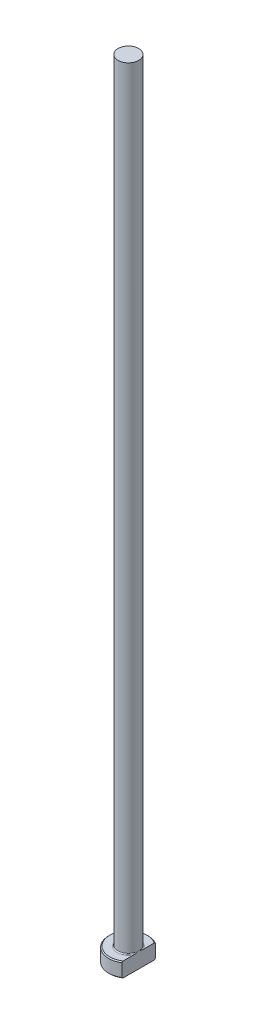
ISO-10303-21;
HEADER;
FILE_DESCRIPTION(('STEP AP214'),'2;1');
FILE_NAME('part.step','',(''),(''),'','','');
FILE_SCHEMA(('AUTOMOTIVE_DESIGN { 1 0 10303 214 1 1 1 1 }'));
ENDSEC;
DATA;
#1=APPLICATION_CONTEXT('core data for automotive mechanical design processes');
#2=APPLICATION_PROTOCOL_DEFINITION('international standard','automotive_design',2000,#1);
#3=PRODUCT_CONTEXT('',#1,'mechanical');
#4=PRODUCT('Part','Part','',(#3));
#5=PRODUCT_RELATED_PRODUCT_CATEGORY('part','',(#4));
#6=PRODUCT_DEFINITION_FORMATION('','',#4);
#7=PRODUCT_DEFINITION_CONTEXT('part definition',#1,'design');
#8=PRODUCT_DEFINITION('design','',#6,#7);
#9=PRODUCT_DEFINITION_SHAPE('','',#8);
#10=(LENGTH_UNIT() NAMED_UNIT(*) SI_UNIT(.MILLI.,.METRE.));
#11=(NAMED_UNIT(*) PLANE_ANGLE_UNIT() SI_UNIT($,.RADIAN.));
#12=(NAMED_UNIT(*) SI_UNIT($,.STERADIAN.) SOLID_ANGLE_UNIT());
#13=UNCERTAINTY_MEASURE_WITH_UNIT(LENGTH_MEASURE(1.E-05),#10,'distance_accuracy_value','');
#14=(GEOMETRIC_REPRESENTATION_CONTEXT(3) GLOBAL_UNCERTAINTY_ASSIGNED_CONTEXT((#13)) GLOBAL_UNIT_ASSIGNED_CONTEXT((#10,
#11,#12)) REPRESENTATION_CONTEXT('',''));
#15=CARTESIAN_POINT('',(0.,0.,0.));
#16=DIRECTION('',(0.,0.,1.));
#17=DIRECTION('',(1.,0.,0.));
#18=AXIS2_PLACEMENT_3D('',#15,#16,#17);
#19=CARTESIAN_POINT('',(0.,0.,0.));
#20=DIRECTION('',(0.,-1.,0.));
#21=DIRECTION('',(0.,0.,-1.));
#22=AXIS2_PLACEMENT_3D('',#19,#20,#21);
#23=PLANE('',#22);
#24=CARTESIAN_POINT('',(0.,0.,0.));
#25=DIRECTION('',(0.,-1.,0.));
#26=DIRECTION('',(0.,0.,-1.));
#27=AXIS2_PLACEMENT_3D('',#24,#25,#26);
#28=CIRCLE('',#27,3.80000000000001);
#29=CARTESIAN_POINT('',(2.09999999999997,0.,3.16701752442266));
#30=VERTEX_POINT('',#29);
#31=CARTESIAN_POINT('',(2.09999999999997,0.,-3.16701752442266));
#32=VERTEX_POINT('',#31);
#33=EDGE_CURVE('E98',#30,#32,#28,.T.);
#34=ORIENTED_EDGE('',*,*,#33,.T.);
#35=DIRECTION('',(0.,0.,1.));
#36=VECTOR('',#35,1.);
#37=CARTESIAN_POINT('',(2.09999999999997,0.,-3.40440890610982));
#38=LINE('',#37,#36);
#39=EDGE_CURVE('E83',#32,#30,#38,.T.);
#40=ORIENTED_EDGE('',*,*,#39,.T.);
#41=EDGE_LOOP('',(#34,#40));
#42=FACE_BOUND('',#41,.T.);
#43=ADVANCED_FACE('F32',(#42),#23,.T.);
#44=CARTESIAN_POINT('',(0.,259.958771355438,0.));
#45=DIRECTION('',(0.,1.,0.));
#46=DIRECTION('',(0.,0.,1.));
#47=AXIS2_PLACEMENT_3D('',#44,#45,#46);
#48=CYLINDRICAL_SURFACE('',#47,3.99999999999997);
#49=CARTESIAN_POINT('',(0.,2.79999999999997,0.));
#50=DIRECTION('',(0.,1.,0.));
#51=DIRECTION('',(0.,0.,1.));
#52=AXIS2_PLACEMENT_3D('',#49,#50,#51);
#53=CIRCLE('',#52,3.99999999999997);
#54=CARTESIAN_POINT('',(2.09999999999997,2.79999999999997,3.40440890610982));
#55=VERTEX_POINT('',#54);
#56=CARTESIAN_POINT('',(2.09999999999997,2.79999999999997,-3.40440890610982));
#57=VERTEX_POINT('',#56);
#58=EDGE_CURVE('E104',#55,#57,#53,.F.);
#59=ORIENTED_EDGE('',*,*,#58,.T.);
#60=DIRECTION('',(0.,-1.,0.));
#61=VECTOR('',#60,1.);
#62=CARTESIAN_POINT('',(2.09999999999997,160.,-3.40440890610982));
#63=LINE('',#62,#61);
#64=CARTESIAN_POINT('',(2.09999999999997,0.199999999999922,-3.40440890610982));
#65=VERTEX_POINT('',#64);
#66=EDGE_CURVE('E183',#57,#65,#63,.T.);
#67=ORIENTED_EDGE('',*,*,#66,.T.);
#68=CARTESIAN_POINT('',(0.,0.199999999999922,0.));
#69=DIRECTION('',(0.,-1.,0.));
#70=DIRECTION('',(0.,0.,-1.));
#71=AXIS2_PLACEMENT_3D('',#68,#69,#70);
#72=CIRCLE('',#71,3.99999999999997);
#73=CARTESIAN_POINT('',(2.09999999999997,0.199999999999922,3.40440890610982));
#74=VERTEX_POINT('',#73);
#75=EDGE_CURVE('E100',#65,#74,#72,.F.);
#76=ORIENTED_EDGE('',*,*,#75,.T.);
#77=DIRECTION('',(0.,-1.,0.));
#78=VECTOR('',#77,1.);
#79=CARTESIAN_POINT('',(2.09999999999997,160.,3.40440890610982));
#80=LINE('',#79,#78);
#81=EDGE_CURVE('E93',#55,#74,#80,.T.);
#82=ORIENTED_EDGE('',*,*,#81,.F.);
#83=EDGE_LOOP('',(#59,#67,#76,#82));
#84=FACE_BOUND('',#83,.T.);
#85=ADVANCED_FACE('F158',(#84),#48,.T.);
#86=CARTESIAN_POINT('',(-3.99999999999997,3.,0.));
#87=DIRECTION('',(0.,1.,0.));
#88=DIRECTION('',(0.,0.,1.));
#89=AXIS2_PLACEMENT_3D('',#86,#87,#88);
#90=PLANE('',#89);
#91=CARTESIAN_POINT('',(0.,3.,0.));
#92=DIRECTION('',(0.,1.,0.));
#93=DIRECTION('',(0.,0.,1.));
#94=AXIS2_PLACEMENT_3D('',#91,#92,#93);
#95=CIRCLE('',#94,3.79999999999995);
#96=CARTESIAN_POINT('',(2.09999999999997,3.,-3.16701752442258));
#97=VERTEX_POINT('',#96);
#98=CARTESIAN_POINT('',(2.09999999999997,3.,3.16701752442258));
#99=VERTEX_POINT('',#98);
#100=EDGE_CURVE('E178',#97,#99,#95,.T.);
#101=ORIENTED_EDGE('',*,*,#100,.T.);
#102=DIRECTION('',(0.,0.,-1.));
#103=VECTOR('',#102,1.);
#104=CARTESIAN_POINT('',(2.09999999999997,3.,0.));
#105=LINE('',#104,#103);
#106=CARTESIAN_POINT('',(2.09999999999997,2.99999999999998,0.938083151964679));
#107=VERTEX_POINT('',#106);
#108=EDGE_CURVE('E57',#99,#107,#105,.T.);
#109=ORIENTED_EDGE('',*,*,#108,.T.);
#110=CARTESIAN_POINT('',(0.,3.,0.));
#111=DIRECTION('',(0.,1.,0.));
#112=DIRECTION('',(0.,0.,1.));
#113=AXIS2_PLACEMENT_3D('',#110,#111,#112);
#114=CIRCLE('',#113,2.29999999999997);
#115=CARTESIAN_POINT('',(2.09999999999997,2.99999999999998,-0.938083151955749));
#116=VERTEX_POINT('',#115);
#117=EDGE_CURVE('E107',#107,#116,#114,.F.);
#118=ORIENTED_EDGE('',*,*,#117,.T.);
#119=EDGE_CURVE('E136',#116,#97,#105,.T.);
#120=ORIENTED_EDGE('',*,*,#119,.T.);
#121=EDGE_LOOP('',(#101,#109,#118,#120));
#122=FACE_BOUND('',#121,.T.);
#123=ADVANCED_FACE('F147',(#122),#90,.T.);
#124=CARTESIAN_POINT('',(0.,3.,0.));
#125=DIRECTION('',(0.,-1.,0.));
#126=DIRECTION('',(0.,0.,-1.));
#127=AXIS2_PLACEMENT_3D('',#124,#125,#126);
#128=CONICAL_SURFACE('',#127,3.79999999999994,0.785398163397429);
#129=ORIENTED_EDGE('',*,*,#58,.F.);
#130=CARTESIAN_POINT('',(2.09999999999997,-0.980423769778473,7.49166163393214));
#131=CARTESIAN_POINT('',(2.09999999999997,-0.831474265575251,7.33696373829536));
#132=CARTESIAN_POINT('',(2.09999999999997,-0.682692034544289,7.1821043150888));
#133=CARTESIAN_POINT('',(2.09999999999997,-0.385548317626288,6.87197961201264));
#134=CARTESIAN_POINT('',(2.09999999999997,-0.237186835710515,6.71671432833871));
#135=CARTESIAN_POINT('',(2.09999999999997,0.0590779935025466,6.40564381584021));
#136=CARTESIAN_POINT('',(2.09999999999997,0.206981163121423,6.24983841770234));
#137=CARTESIAN_POINT('',(2.09999999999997,0.502154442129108,5.9376299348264));
#138=CARTESIAN_POINT('',(2.09999999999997,0.649424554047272,5.78122685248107));
#139=CARTESIAN_POINT('',(2.09999999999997,0.940776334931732,5.47022973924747));
#140=CARTESIAN_POINT('',(2.09999999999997,1.08487085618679,5.31564775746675));
#141=CARTESIAN_POINT('',(2.09999999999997,1.372076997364,5.0055736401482));
#142=CARTESIAN_POINT('',(2.09999999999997,1.51518862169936,4.85008150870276));
#143=CARTESIAN_POINT('',(2.09999999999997,1.80010839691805,4.53794892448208));
#144=CARTESIAN_POINT('',(2.09999999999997,1.94191674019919,4.38130864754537));
#145=CARTESIAN_POINT('',(2.09999999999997,2.22381768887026,4.0664938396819));
#146=CARTESIAN_POINT('',(2.09999999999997,2.36391033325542,3.90831934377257));
#147=CARTESIAN_POINT('',(2.09999999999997,2.60581733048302,3.63104485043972));
#148=CARTESIAN_POINT('',(2.09999999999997,2.70816653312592,3.51241214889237));
#149=CARTESIAN_POINT('',(2.09999999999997,2.91116695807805,3.27367935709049));
#150=CARTESIAN_POINT('',(2.09999999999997,3.01181801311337,3.15357912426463));
#151=CARTESIAN_POINT('',(2.09999999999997,3.21179811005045,2.91033378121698));
#152=CARTESIAN_POINT('',(2.09999999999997,3.3111051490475,2.7871705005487));
#153=CARTESIAN_POINT('',(2.09999999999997,3.50648239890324,2.53834531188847));
#154=CARTESIAN_POINT('',(2.09999999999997,3.60255343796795,2.41268405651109));
#155=CARTESIAN_POINT('',(2.09999999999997,3.79142541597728,2.15619995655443));
#156=CARTESIAN_POINT('',(2.09999999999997,3.88416307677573,2.02532985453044));
#157=CARTESIAN_POINT('',(2.09999999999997,4.01801013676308,1.82534891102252));
#158=CARTESIAN_POINT('',(2.09999999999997,4.06178099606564,1.75802258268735));
#159=CARTESIAN_POINT('',(2.09999999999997,4.14708263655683,1.6219702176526));
#160=CARTESIAN_POINT('',(2.09999999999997,4.18861364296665,1.55324432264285));
#161=CARTESIAN_POINT('',(2.09999999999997,4.2684305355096,1.41491925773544));
#162=CARTESIAN_POINT('',(2.09999999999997,4.30674712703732,1.34533804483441));
#163=CARTESIAN_POINT('',(2.09999999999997,4.37989810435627,1.20437862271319));
#164=CARTESIAN_POINT('',(2.09999999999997,4.41473181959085,1.13300007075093));
#165=CARTESIAN_POINT('',(2.09999999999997,4.51246602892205,0.916193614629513));
#166=CARTESIAN_POINT('',(2.09999999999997,4.56890635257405,0.767589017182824));
#167=CARTESIAN_POINT('',(2.09999999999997,4.63146309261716,0.545044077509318));
#168=CARTESIAN_POINT('',(2.09999999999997,4.6482991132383,0.474096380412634));
#169=CARTESIAN_POINT('',(2.09999999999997,4.67524959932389,0.330910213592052));
#170=CARTESIAN_POINT('',(2.09999999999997,4.68536485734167,0.258671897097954));
#171=CARTESIAN_POINT('',(2.09999999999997,4.69814808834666,0.113837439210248));
#172=CARTESIAN_POINT('',(2.09999999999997,4.70084750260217,0.0412441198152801));
#173=CARTESIAN_POINT('',(2.09999999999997,4.69868618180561,-0.103832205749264));
#174=CARTESIAN_POINT('',(2.09999999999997,4.69382503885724,-0.176315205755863));
#175=CARTESIAN_POINT('',(2.09999999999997,4.67696192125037,-0.319913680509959));
#176=CARTESIAN_POINT('',(2.09999999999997,4.66501009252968,-0.391035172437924));
#177=CARTESIAN_POINT('',(2.09999999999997,4.63477414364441,-0.531925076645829));
#178=CARTESIAN_POINT('',(2.09999999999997,4.61648741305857,-0.601692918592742));
#179=CARTESIAN_POINT('',(2.09999999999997,4.57440952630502,-0.740018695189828));
#180=CARTESIAN_POINT('',(2.09999999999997,4.55058348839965,-0.808565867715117));
#181=CARTESIAN_POINT('',(2.09999999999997,4.49846635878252,-0.943903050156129));
#182=CARTESIAN_POINT('',(2.09999999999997,4.47017609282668,-1.01069338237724));
#183=CARTESIAN_POINT('',(2.09999999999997,4.38350646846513,-1.20069593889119));
#184=CARTESIAN_POINT('',(2.09999999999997,4.32056256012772,-1.3218187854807));
#185=CARTESIAN_POINT('',(2.09999999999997,4.18621189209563,-1.55931752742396));
#186=CARTESIAN_POINT('',(2.09999999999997,4.11479535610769,-1.67568772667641));
#187=CARTESIAN_POINT('',(2.09999999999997,3.96595132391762,-1.90511626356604));
#188=CARTESIAN_POINT('',(2.09999999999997,3.88850194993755,-2.0181602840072));
#189=CARTESIAN_POINT('',(2.09999999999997,3.7296086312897,-2.24129989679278));
#190=CARTESIAN_POINT('',(2.09999999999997,3.64816653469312,-2.3513968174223));
#191=CARTESIAN_POINT('',(2.09999999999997,3.4813341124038,-2.57073305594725));
#192=CARTESIAN_POINT('',(2.09999999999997,3.39590709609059,-2.67994433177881));
#193=CARTESIAN_POINT('',(2.09999999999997,3.22283750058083,-2.89660720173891));
#194=CARTESIAN_POINT('',(2.09999999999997,3.1351947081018,-3.0040586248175));
#195=CARTESIAN_POINT('',(2.09999999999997,2.95843815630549,-3.2173196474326));
#196=CARTESIAN_POINT('',(2.09999999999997,2.86932829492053,-3.32313248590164));
#197=CARTESIAN_POINT('',(2.09999999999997,2.68980874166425,-3.53365081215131));
#198=CARTESIAN_POINT('',(2.09999999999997,2.59939902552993,-3.63835627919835));
#199=CARTESIAN_POINT('',(2.09999999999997,2.36547490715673,-3.90659393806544));
#200=CARTESIAN_POINT('',(2.09999999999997,2.22120602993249,-4.06946765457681));
#201=CARTESIAN_POINT('',(2.09999999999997,1.93085962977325,-4.39359699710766));
#202=CARTESIAN_POINT('',(2.09999999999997,1.78478206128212,-4.55485258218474));
#203=CARTESIAN_POINT('',(2.09999999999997,1.49115582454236,-4.87627982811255));
#204=CARTESIAN_POINT('',(2.09999999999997,1.3436059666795,-5.03645040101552));
#205=CARTESIAN_POINT('',(2.09999999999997,1.04748117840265,-5.3558413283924));
#206=CARTESIAN_POINT('',(2.09999999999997,0.898906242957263,-5.51506167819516));
#207=CARTESIAN_POINT('',(2.09999999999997,0.463656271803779,-5.97917774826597));
#208=CARTESIAN_POINT('',(2.09999999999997,0.175917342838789,-6.28307552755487));
#209=CARTESIAN_POINT('',(2.09999999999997,-0.25695367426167,-6.73740739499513));
#210=CARTESIAN_POINT('',(2.09999999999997,-0.401377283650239,-6.88851889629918));
#211=CARTESIAN_POINT('',(2.09999999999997,-0.690621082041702,-7.1903594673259));
#212=CARTESIAN_POINT('',(2.09999999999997,-0.835441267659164,-7.34108854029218));
#213=CARTESIAN_POINT('',(2.09999999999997,-0.980423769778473,-7.49166163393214));
#214=B_SPLINE_CURVE_WITH_KNOTS('',3,(#130,#131,#132,#133,#134,#135,#136,#137,#138,#139,#140,
#141,#142,#143,#144,#145,#146,#147,#148,#149,#150,#151,#152,#153,#154,#155,#156,#157,#158,#159,
#160,#161,#162,#163,#164,#165,#166,#167,#168,#169,#170,#171,#172,#173,#174,#175,#176,#177,#178,
#179,#180,#181,#182,#183,#184,#185,#186,#187,#188,#189,#190,#191,#192,#193,#194,#195,#196,#197,
#198,#199,#200,#201,#202,#203,#204,#205,#206,#207,#208,#209,#210,#211,#212,#213),.UNSPECIFIED.,
.F.,.F.,(4,2,2,2,2,2,2,2,2,2,2,2,2,2,2,2,2,2,2,2,2,2,2,2,2,2,2,2,2,2,2,2,2,2,2,2,2,2,2,2,2,4),
(0.,0.644249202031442,1.28850446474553,1.93298425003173,2.577461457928,3.21143723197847,
3.84541015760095,4.47928793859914,5.11315128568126,5.58318355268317,6.05326185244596,
6.52785804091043,7.00233182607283,7.48334172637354,7.72421875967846,7.96507152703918,
8.20327136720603,8.441516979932,8.91624038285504,9.13473354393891,9.35320093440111,
9.57074063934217,9.78829208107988,10.0043230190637,10.2204430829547,10.4379628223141,
10.6554423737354,11.0643686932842,11.4737715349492,11.8847351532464,12.2955103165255,
12.7114337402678,13.1273973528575,13.5423929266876,13.9573962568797,14.6101174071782,
15.2628550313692,15.9161714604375,16.5694910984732,17.8249945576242,18.452079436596,
19.0791589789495),.UNSPECIFIED.);
#215=EDGE_CURVE('E135',#55,#99,#214,.T.);
#216=ORIENTED_EDGE('',*,*,#215,.T.);
#217=ORIENTED_EDGE('',*,*,#100,.F.);
#218=EDGE_CURVE('E127',#97,#57,#214,.T.);
#219=ORIENTED_EDGE('',*,*,#218,.T.);
#220=EDGE_LOOP('',(#129,#216,#217,#219));
#221=FACE_BOUND('',#220,.T.);
#222=ADVANCED_FACE('F143',(#221),#128,.T.);
#223=CARTESIAN_POINT('',(0.,0.199999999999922,0.));
#224=DIRECTION('',(0.,1.,0.));
#225=DIRECTION('',(0.,0.,1.));
#226=AXIS2_PLACEMENT_3D('',#223,#224,#225);
#227=CONICAL_SURFACE('',#226,3.99999999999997,0.785398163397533);
#228=ORIENTED_EDGE('',*,*,#75,.F.);
#229=CARTESIAN_POINT('',(2.09999999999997,3.98042376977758,-7.49166163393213));
#230=CARTESIAN_POINT('',(2.09999999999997,3.8314742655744,-7.33696373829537));
#231=CARTESIAN_POINT('',(2.09999999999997,3.68269203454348,-7.18210431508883));
#232=CARTESIAN_POINT('',(2.09999999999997,3.38554831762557,-6.8719796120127));
#233=CARTESIAN_POINT('',(2.09999999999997,3.23718683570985,-6.71671432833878));
#234=CARTESIAN_POINT('',(2.09999999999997,2.94092200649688,-6.40564381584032));
#235=CARTESIAN_POINT('',(2.09999999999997,2.79301883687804,-6.24983841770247));
#236=CARTESIAN_POINT('',(2.09999999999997,2.49784555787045,-5.93762993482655));
#237=CARTESIAN_POINT('',(2.09999999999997,2.35057544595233,-5.78122685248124));
#238=CARTESIAN_POINT('',(2.09999999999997,2.05922366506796,-5.47022973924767));
#239=CARTESIAN_POINT('',(2.09999999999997,1.91512914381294,-5.31564775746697));
#240=CARTESIAN_POINT('',(2.09999999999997,1.62792300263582,-5.00557364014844));
#241=CARTESIAN_POINT('',(2.09999999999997,1.4848113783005,-4.85008150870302));
#242=CARTESIAN_POINT('',(2.09999999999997,1.19989160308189,-4.53794892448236));
#243=CARTESIAN_POINT('',(2.09999999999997,1.0580832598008,-4.38130864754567));
#244=CARTESIAN_POINT('',(2.09999999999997,0.776182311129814,-4.06649383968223));
#245=CARTESIAN_POINT('',(2.09999999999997,0.636089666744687,-3.90831934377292));
#246=CARTESIAN_POINT('',(2.09999999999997,0.394182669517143,-3.63104485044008));
#247=CARTESIAN_POINT('',(2.09999999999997,0.291833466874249,-3.51241214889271));
#248=CARTESIAN_POINT('',(2.09999999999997,0.088833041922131,-3.27367935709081));
#249=CARTESIAN_POINT('',(2.09999999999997,-0.0118180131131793,-3.15357912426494));
#250=CARTESIAN_POINT('',(2.09999999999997,-0.211798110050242,-2.91033378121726));
#251=CARTESIAN_POINT('',(2.09999999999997,-0.31110514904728,-2.78717050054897));
#252=CARTESIAN_POINT('',(2.09999999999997,-0.506482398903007,-2.53834531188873));
#253=CARTESIAN_POINT('',(2.09999999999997,-0.602553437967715,-2.41268405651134));
#254=CARTESIAN_POINT('',(2.09999999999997,-0.791425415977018,-2.15619995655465));
#255=CARTESIAN_POINT('',(2.09999999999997,-0.88416307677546,-2.02532985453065));
#256=CARTESIAN_POINT('',(2.09999999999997,-1.0180101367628,-1.82534891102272));
#257=CARTESIAN_POINT('',(2.09999999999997,-1.06178099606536,-1.75802258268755));
#258=CARTESIAN_POINT('',(2.09999999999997,-1.14708263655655,-1.62197021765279));
#259=CARTESIAN_POINT('',(2.09999999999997,-1.18861364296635,-1.55324432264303));
#260=CARTESIAN_POINT('',(2.09999999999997,-1.2684305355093,-1.41491925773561));
#261=CARTESIAN_POINT('',(2.09999999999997,-1.30674712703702,-1.34533804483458));
#262=CARTESIAN_POINT('',(2.09999999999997,-1.37989810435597,-1.20437862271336));
#263=CARTESIAN_POINT('',(2.09999999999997,-1.41473181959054,-1.1330000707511));
#264=CARTESIAN_POINT('',(2.09999999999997,-1.51246602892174,-0.916193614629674));
#265=CARTESIAN_POINT('',(2.09999999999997,-1.56890635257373,-0.767589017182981));
#266=CARTESIAN_POINT('',(2.09999999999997,-1.63146309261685,-0.545044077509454));
#267=CARTESIAN_POINT('',(2.09999999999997,-1.64829911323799,-0.474096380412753));
#268=CARTESIAN_POINT('',(2.09999999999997,-1.6752495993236,-0.330910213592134));
#269=CARTESIAN_POINT('',(2.09999999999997,-1.68536485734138,-0.258671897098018));
#270=CARTESIAN_POINT('',(2.09999999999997,-1.69814808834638,-0.113837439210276));
#271=CARTESIAN_POINT('',(2.09999999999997,-1.70084750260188,-0.0412441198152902));
#272=CARTESIAN_POINT('',(2.09999999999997,-1.69868618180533,0.10383220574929));
#273=CARTESIAN_POINT('',(2.09999999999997,-1.69382503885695,0.176315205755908));
#274=CARTESIAN_POINT('',(2.09999999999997,-1.67696192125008,0.31991368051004));
#275=CARTESIAN_POINT('',(2.09999999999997,-1.66501009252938,0.391035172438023));
#276=CARTESIAN_POINT('',(2.09999999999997,-1.6347741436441,0.531925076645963));
#277=CARTESIAN_POINT('',(2.09999999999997,-1.61648741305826,0.601692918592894));
#278=CARTESIAN_POINT('',(2.09999999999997,-1.57440952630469,0.740018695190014));
#279=CARTESIAN_POINT('',(2.09999999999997,-1.55058348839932,0.808565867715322));
#280=CARTESIAN_POINT('',(2.09999999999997,-1.49846635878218,0.943903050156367));
#281=CARTESIAN_POINT('',(2.09999999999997,-1.47017609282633,1.01069338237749));
#282=CARTESIAN_POINT('',(2.09999999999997,-1.38350646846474,1.20069593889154));
#283=CARTESIAN_POINT('',(2.09999999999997,-1.32056256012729,1.32181878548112));
#284=CARTESIAN_POINT('',(2.09999999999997,-1.18621189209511,1.55931752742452));
#285=CARTESIAN_POINT('',(2.09999999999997,-1.11479535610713,1.67568772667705));
#286=CARTESIAN_POINT('',(2.09999999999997,-0.965951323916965,1.90511626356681));
#287=CARTESIAN_POINT('',(2.09999999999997,-0.888501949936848,2.01816028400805));
#288=CARTESIAN_POINT('',(2.09999999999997,-0.729608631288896,2.24129989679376));
#289=CARTESIAN_POINT('',(2.09999999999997,-0.648166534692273,2.35139681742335));
#290=CARTESIAN_POINT('',(2.09999999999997,-0.481334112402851,2.57073305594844));
#291=CARTESIAN_POINT('',(2.09999999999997,-0.395907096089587,2.67994433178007));
#292=CARTESIAN_POINT('',(2.09999999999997,-0.222837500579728,2.89660720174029));
#293=CARTESIAN_POINT('',(2.09999999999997,-0.135194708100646,3.00405862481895));
#294=CARTESIAN_POINT('',(2.09999999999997,0.0415618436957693,3.21731964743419));
#295=CARTESIAN_POINT('',(2.09999999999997,0.130671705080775,3.32313248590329));
#296=CARTESIAN_POINT('',(2.09999999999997,0.310191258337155,3.5336508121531));
#297=CARTESIAN_POINT('',(2.09999999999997,0.40060097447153,3.63835627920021));
#298=CARTESIAN_POINT('',(2.09999999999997,0.634525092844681,3.90659393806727));
#299=CARTESIAN_POINT('',(2.09999999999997,0.778793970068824,4.06946765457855));
#300=CARTESIAN_POINT('',(2.09999999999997,1.06914037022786,4.39359699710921));
#301=CARTESIAN_POINT('',(2.09999999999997,1.21521793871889,4.5548525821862));
#302=CARTESIAN_POINT('',(2.09999999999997,1.50884417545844,4.87627982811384));
#303=CARTESIAN_POINT('',(2.09999999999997,1.65639403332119,5.03645040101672));
#304=CARTESIAN_POINT('',(2.09999999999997,1.95251882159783,5.35584132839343));
#305=CARTESIAN_POINT('',(2.09999999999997,2.10109375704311,5.5150616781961));
#306=CARTESIAN_POINT('',(2.09999999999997,2.5363437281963,5.97917774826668));
#307=CARTESIAN_POINT('',(2.09999999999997,2.82408265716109,6.28307552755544));
#308=CARTESIAN_POINT('',(2.09999999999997,3.25695367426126,6.73740739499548));
#309=CARTESIAN_POINT('',(2.09999999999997,3.40137728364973,6.88851889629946));
#310=CARTESIAN_POINT('',(2.09999999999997,3.690621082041,7.19035946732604));
#311=CARTESIAN_POINT('',(2.09999999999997,3.83544126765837,7.34108854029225));
#312=CARTESIAN_POINT('',(2.09999999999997,3.98042376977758,7.49166163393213));
#313=B_SPLINE_CURVE_WITH_KNOTS('',3,(#229,#230,#231,#232,#233,#234,#235,#236,#237,#238,#239,
#240,#241,#242,#243,#244,#245,#246,#247,#248,#249,#250,#251,#252,#253,#254,#255,#256,#257,#258,
#259,#260,#261,#262,#263,#264,#265,#266,#267,#268,#269,#270,#271,#272,#273,#274,#275,#276,#277,
#278,#279,#280,#281,#282,#283,#284,#285,#286,#287,#288,#289,#290,#291,#292,#293,#294,#295,#296,
#297,#298,#299,#300,#301,#302,#303,#304,#305,#306,#307,#308,#309,#310,#311,#312),.UNSPECIFIED.,
.F.,.F.,(4,2,2,2,2,2,2,2,2,2,2,2,2,2,2,2,2,2,2,2,2,2,2,2,2,2,2,2,2,2,2,2,2,2,2,2,2,2,2,2,2,4),
(0.,0.644249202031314,1.28850446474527,1.93298425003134,2.57746145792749,3.21143723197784,
3.84541015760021,4.47928793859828,5.11315128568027,5.5831835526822,6.053261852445,
6.52785804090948,7.00233182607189,7.48334172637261,7.72421875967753,7.96507152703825,
8.20327136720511,8.44151697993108,8.91624038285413,9.13473354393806,9.35320093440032,
9.57074063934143,9.7882920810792,10.0043230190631,10.2204430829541,10.4379628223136,
10.6554423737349,11.064368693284,11.4737715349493,11.8847351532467,12.295510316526,
12.7114337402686,13.1273973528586,13.5423929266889,13.9573962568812,14.6101174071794,
15.2628550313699,15.9161714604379,16.5694910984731,17.8249945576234,18.4520794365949,
19.079158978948),.UNSPECIFIED.);
#314=EDGE_CURVE('E86',#65,#32,#313,.T.);
#315=ORIENTED_EDGE('',*,*,#314,.T.);
#316=ORIENTED_EDGE('',*,*,#33,.F.);
#317=EDGE_CURVE('E89',#30,#74,#313,.T.);
#318=ORIENTED_EDGE('',*,*,#317,.T.);
#319=EDGE_LOOP('',(#228,#315,#316,#318));
#320=FACE_BOUND('',#319,.T.);
#321=ADVANCED_FACE('F97',(#320),#227,.T.);
#322=CARTESIAN_POINT('',(0.,3.19999999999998,0.));
#323=DIRECTION('',(0.,1.,0.));
#324=DIRECTION('',(0.,0.,1.));
#325=AXIS2_PLACEMENT_3D('',#322,#323,#324);
#326=TOROIDAL_SURFACE('',#325,2.29999999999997,0.2);
#327=CARTESIAN_POINT('',(2.09999999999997,3.19999999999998,0.));
#328=CARTESIAN_POINT('',(2.09999999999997,3.20000050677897,1.12871213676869E-10));
#329=CARTESIAN_POINT('',(2.09999999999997,3.20000101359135,-1.5160230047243E-07));
#330=CARTESIAN_POINT('',(2.09999999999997,3.20000197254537,-5.98005719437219E-07));
#331=CARTESIAN_POINT('',(2.09999999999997,3.2000024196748,-9.0062574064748E-07));
#332=CARTESIAN_POINT('',(2.09999999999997,3.20000332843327,-1.62318945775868E-06));
#333=CARTESIAN_POINT('',(2.09999999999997,3.20000378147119,-2.05406588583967E-06));
#334=CARTESIAN_POINT('',(2.09999999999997,3.20000461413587,-2.96308561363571E-06));
#335=CARTESIAN_POINT('',(2.09999999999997,3.20000499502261,-3.4401425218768E-06));
#336=CARTESIAN_POINT('',(2.09999999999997,3.20000634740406,-5.22586037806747E-06));
#337=CARTESIAN_POINT('',(2.09999999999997,3.20000724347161,-6.59340897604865E-06));
#338=CARTESIAN_POINT('',(2.09999999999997,3.20000877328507,-9.35203600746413E-06));
#339=CARTESIAN_POINT('',(2.09999999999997,3.20000941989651,-1.07363396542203E-05));
#340=CARTESIAN_POINT('',(2.09999999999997,3.20001201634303,-1.6407290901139E-05));
#341=CARTESIAN_POINT('',(2.09999999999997,3.20001387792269,-2.07387533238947E-05));
#342=CARTESIAN_POINT('',(2.09999999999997,3.2000167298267,-2.90585196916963E-05));
#343=CARTESIAN_POINT('',(2.09999999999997,3.20001780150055,-3.30191375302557E-05));
#344=CARTESIAN_POINT('',(2.09999999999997,3.20002541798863,-6.18759983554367E-05));
#345=CARTESIAN_POINT('',(2.09999999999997,3.20003100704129,-8.69774695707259E-05));
#346=CARTESIAN_POINT('',(2.09999999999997,3.20005545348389,-0.000185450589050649));
#347=CARTESIAN_POINT('',(2.09999999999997,3.20007895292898,-0.000257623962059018));
#348=CARTESIAN_POINT('',(2.09999999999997,3.20016974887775,-0.000541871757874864));
#349=CARTESIAN_POINT('',(2.09999999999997,3.20023388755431,-0.000754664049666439));
#350=CARTESIAN_POINT('',(2.09999999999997,3.20048929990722,-0.00159500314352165));
#351=CARTESIAN_POINT('',(2.09999999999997,3.2006844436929,-0.00222165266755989));
#352=CARTESIAN_POINT('',(2.09999999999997,3.2014903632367,-0.00481735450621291));
#353=CARTESIAN_POINT('',(2.09999999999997,3.2020963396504,-0.0067875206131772));
#354=CARTESIAN_POINT('',(2.09999999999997,3.20811857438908,-0.0263575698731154));
#355=CARTESIAN_POINT('',(2.09999999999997,3.21355673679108,-0.0439525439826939));
#356=CARTESIAN_POINT('',(2.09999999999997,3.22417769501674,-0.078471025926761));
#357=CARTESIAN_POINT('',(2.09999999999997,3.22936219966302,-0.0953940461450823));
#358=CARTESIAN_POINT('',(2.09999999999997,3.24031741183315,-0.131344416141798));
#359=CARTESIAN_POINT('',(2.09999999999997,3.24608153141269,-0.150373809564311));
#360=CARTESIAN_POINT('',(2.09999999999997,3.25756719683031,-0.188666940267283));
#361=CARTESIAN_POINT('',(2.09999999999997,3.263287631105,-0.207931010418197));
#362=CARTESIAN_POINT('',(2.09999999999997,3.27708776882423,-0.255037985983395));
#363=CARTESIAN_POINT('',(2.09999999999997,3.2850908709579,-0.282903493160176));
#364=CARTESIAN_POINT('',(2.09999999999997,3.30049018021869,-0.33805925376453));
#365=CARTESIAN_POINT('',(2.09999999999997,3.30789650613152,-0.365346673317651));
#366=CARTESIAN_POINT('',(2.09999999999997,3.32422959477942,-0.427831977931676));
#367=CARTESIAN_POINT('',(2.09999999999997,3.33299018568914,-0.46307381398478));
#368=CARTESIAN_POINT('',(2.09999999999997,3.34944378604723,-0.534083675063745));
#369=CARTESIAN_POINT('',(2.09999999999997,3.35712842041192,-0.569853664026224));
#370=CARTESIAN_POINT('',(2.09999999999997,3.37150595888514,-0.644262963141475));
#371=CARTESIAN_POINT('',(2.09999999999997,3.37808822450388,-0.682924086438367));
#372=CARTESIAN_POINT('',(2.09999999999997,3.38900927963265,-0.760558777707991));
#373=CARTESIAN_POINT('',(2.09999999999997,3.39334901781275,-0.799532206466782));
#374=CARTESIAN_POINT('',(2.09999999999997,3.39885385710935,-0.874699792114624));
#375=CARTESIAN_POINT('',(2.09999999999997,3.40023755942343,-0.910877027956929));
#376=CARTESIAN_POINT('',(2.09999999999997,3.39969515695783,-0.983205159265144));
#377=CARTESIAN_POINT('',(2.09999999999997,3.39777304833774,-1.01935603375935));
#378=CARTESIAN_POINT('',(2.09999999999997,3.39020522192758,-1.08431292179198));
#379=CARTESIAN_POINT('',(2.09999999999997,3.38533825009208,-1.11320671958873));
#380=CARTESIAN_POINT('',(2.09999999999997,3.37160685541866,-1.1700898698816));
#381=CARTESIAN_POINT('',(2.09999999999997,3.36275087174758,-1.19808099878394));
#382=CARTESIAN_POINT('',(2.09999999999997,3.34648318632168,-1.23525714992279));
#383=CARTESIAN_POINT('',(2.09999999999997,3.34148711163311,-1.24549622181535));
#384=CARTESIAN_POINT('',(2.09999999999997,3.33045865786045,-1.26542566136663));
#385=CARTESIAN_POINT('',(2.09999999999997,3.32442526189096,-1.27511547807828));
#386=CARTESIAN_POINT('',(2.09999999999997,3.31108244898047,-1.29375285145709));
#387=CARTESIAN_POINT('',(2.09999999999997,3.30375956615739,-1.30269093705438));
#388=CARTESIAN_POINT('',(2.09999999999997,3.28770931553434,-1.31920846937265));
#389=CARTESIAN_POINT('',(2.09999999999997,3.27898657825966,-1.32679222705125));
#390=CARTESIAN_POINT('',(2.09999999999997,3.26379332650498,-1.33730272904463));
#391=CARTESIAN_POINT('',(2.09999999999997,3.25778099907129,-1.34088947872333));
#392=CARTESIAN_POINT('',(2.09999999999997,3.24526530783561,-1.34707853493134));
#393=CARTESIAN_POINT('',(2.09999999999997,3.23876236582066,-1.34968167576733));
#394=CARTESIAN_POINT('',(2.09999999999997,3.22533138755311,-1.35371298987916));
#395=CARTESIAN_POINT('',(2.09999999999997,3.21840009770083,-1.35513055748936));
#396=CARTESIAN_POINT('',(2.09999999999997,3.2043942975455,-1.35660326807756));
#397=CARTESIAN_POINT('',(2.09999999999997,3.19731988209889,-1.35665928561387));
#398=CARTESIAN_POINT('',(2.09999999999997,3.18410044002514,-1.35547833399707));
#399=CARTESIAN_POINT('',(2.09999999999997,3.17794157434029,-1.3543883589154));
#400=CARTESIAN_POINT('',(2.09999999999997,3.16588195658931,-1.35123020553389));
#401=CARTESIAN_POINT('',(2.09999999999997,3.15998132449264,-1.34916157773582));
#402=CARTESIAN_POINT('',(2.09999999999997,3.14673410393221,-1.34339681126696));
#403=CARTESIAN_POINT('',(2.09999999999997,3.13952216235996,-1.33939261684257));
#404=CARTESIAN_POINT('',(2.09999999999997,3.1258371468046,-1.33027651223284));
#405=CARTESIAN_POINT('',(2.09999999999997,3.11936569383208,-1.3251622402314));
#406=CARTESIAN_POINT('',(2.09999999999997,3.10400061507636,-1.31126465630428));
#407=CARTESIAN_POINT('',(2.09999999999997,3.09558831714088,-1.3019528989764));
#408=CARTESIAN_POINT('',(2.09999999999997,3.0802757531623,-1.28218529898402));
#409=CARTESIAN_POINT('',(2.09999999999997,3.07337755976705,-1.27172791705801));
#410=CARTESIAN_POINT('',(2.09999999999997,3.05595453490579,-1.24164701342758));
#411=CARTESIAN_POINT('',(2.09999999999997,3.0467992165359,-1.22123760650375));
#412=CARTESIAN_POINT('',(2.09999999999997,3.03140603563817,-1.17923303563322));
#413=CARTESIAN_POINT('',(2.09999999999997,3.02519350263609,-1.15762930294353));
#414=CARTESIAN_POINT('',(2.09999999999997,3.014897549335,-1.11311363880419));
#415=CARTESIAN_POINT('',(2.09999999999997,3.01089884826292,-1.09018261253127));
#416=CARTESIAN_POINT('',(2.09999999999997,3.00485282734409,-1.04403569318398));
#417=CARTESIAN_POINT('',(2.09999999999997,3.00280937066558,-1.02081932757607));
#418=CARTESIAN_POINT('',(2.09999999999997,2.99913236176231,-0.952629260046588));
#419=CARTESIAN_POINT('',(2.09999999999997,2.99965574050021,-0.907543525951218));
#420=CARTESIAN_POINT('',(2.09999999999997,3.00580977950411,-0.79983290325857));
#421=CARTESIAN_POINT('',(2.09999999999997,3.01338406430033,-0.737345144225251));
#422=CARTESIAN_POINT('',(2.09999999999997,3.03389167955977,-0.611758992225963));
#423=CARTESIAN_POINT('',(2.09999999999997,3.04695134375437,-0.548682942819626));
#424=CARTESIAN_POINT('',(2.09999999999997,3.07174522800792,-0.44346393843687));
#425=CARTESIAN_POINT('',(2.09999999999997,3.08256100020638,-0.401095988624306));
#426=CARTESIAN_POINT('',(2.09999999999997,3.10517491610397,-0.317118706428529));
#427=CARTESIAN_POINT('',(2.09999999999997,3.11696109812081,-0.275506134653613));
#428=CARTESIAN_POINT('',(2.09999999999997,3.13984946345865,-0.197106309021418));
#429=CARTESIAN_POINT('',(2.09999999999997,3.15088145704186,-0.160298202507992));
#430=CARTESIAN_POINT('',(2.09999999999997,3.17371469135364,-0.0852465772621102));
#431=CARTESIAN_POINT('',(2.09999999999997,3.18552885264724,-0.0470069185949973));
#432=CARTESIAN_POINT('',(2.09999999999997,3.1979046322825,-0.00678406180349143));
#433=CARTESIAN_POINT('',(2.09999999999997,3.19851173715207,-0.0048104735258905));
#434=CARTESIAN_POINT('',(2.09999999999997,3.19931792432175,-0.00221397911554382));
#435=CARTESIAN_POINT('',(2.09999999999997,3.19951224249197,-0.00158996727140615));
#436=CARTESIAN_POINT('',(2.09999999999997,3.19976664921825,-0.000752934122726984));
#437=CARTESIAN_POINT('',(2.09999999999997,3.1998305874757,-0.000540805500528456));
#438=CARTESIAN_POINT('',(2.09999999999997,3.19992113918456,-0.00025733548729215));
#439=CARTESIAN_POINT('',(2.09999999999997,3.19994460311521,-0.000185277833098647));
#440=CARTESIAN_POINT('',(2.09999999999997,3.19996901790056,-8.69395480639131E-05));
#441=CARTESIAN_POINT('',(2.09999999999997,3.1999746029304,-6.18551879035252E-05));
#442=CARTESIAN_POINT('',(2.09999999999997,3.19998221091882,-3.30155874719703E-05));
#443=CARTESIAN_POINT('',(2.09999999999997,3.19998328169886,-2.90560037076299E-05));
#444=CARTESIAN_POINT('',(2.09999999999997,3.19998613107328,-2.07382812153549E-05));
#445=CARTESIAN_POINT('',(2.09999999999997,3.19998799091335,-1.64077754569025E-05));
#446=CARTESIAN_POINT('',(2.09999999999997,3.19999058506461,-1.0737787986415E-05));
#447=CARTESIAN_POINT('',(2.09999999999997,3.19999123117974,-9.35356155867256E-06));
#448=CARTESIAN_POINT('',(2.09999999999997,3.19999275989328,-6.59500016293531E-06));
#449=CARTESIAN_POINT('',(2.09999999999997,3.19999365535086,-5.22743189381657E-06));
#450=CARTESIAN_POINT('',(2.09999999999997,3.19999500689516,-3.44158185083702E-06));
#451=CARTESIAN_POINT('',(2.09999999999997,3.19999538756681,-2.96446374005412E-06));
#452=CARTESIAN_POINT('',(2.09999999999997,3.19999621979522,-2.05528284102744E-06));
#453=CARTESIAN_POINT('',(2.09999999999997,3.1999966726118,-1.62430552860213E-06));
#454=CARTESIAN_POINT('',(2.09999999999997,3.19999758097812,-9.01501322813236E-07));
#455=CARTESIAN_POINT('',(2.09999999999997,3.19999802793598,-5.98749119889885E-07));
#456=CARTESIAN_POINT('',(2.09999999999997,3.19999898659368,-1.52018312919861E-07));
#457=CARTESIAN_POINT('',(2.09999999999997,3.19999949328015,-1.12858037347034E-10));
#458=CARTESIAN_POINT('',(2.09999999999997,3.19999999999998,0.));
#459=B_SPLINE_CURVE_WITH_KNOTS('',3,(#327,#328,#329,#330,#331,#332,#333,#334,#335,#336,#337,
#338,#339,#340,#341,#342,#343,#344,#345,#346,#347,#348,#349,#350,#351,#352,#353,#354,#355,#356,
#357,#358,#359,#360,#361,#362,#363,#364,#365,#366,#367,#368,#369,#370,#371,#372,#373,#374,#375,
#376,#377,#378,#379,#380,#381,#382,#383,#384,#385,#386,#387,#388,#389,#390,#391,#392,#393,#394,
#395,#396,#397,#398,#399,#400,#401,#402,#403,#404,#405,#406,#407,#408,#409,#410,#411,#412,#413,
#414,#415,#416,#417,#418,#419,#420,#421,#422,#423,#424,#425,#426,#427,#428,#429,#430,#431,#432,
#433,#434,#435,#436,#437,#438,#439,#440,#441,#442,#443,#444,#445,#446,#447,#448,#449,#450,#451,
#452,#453,#454,#455,#456,#457,#458),.UNSPECIFIED.,.T.,.F.,(4,2,2,2,2,2,2,2,2,2,2,2,2,2,2,2,2,2,
2,2,2,2,2,2,2,2,2,2,2,2,2,2,2,2,2,2,2,2,2,2,2,2,2,2,2,2,2,2,2,2,2,2,2,2,2,2,2,2,2,2,2,2,2,2,2,
4),(0.,1.52446483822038E-06,3.13917159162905E-06,5.00540711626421E-06,6.83522638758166E-06,
1.1719467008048E-05,1.62993936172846E-05,3.04103902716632E-05,4.27033722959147E-05,
0.000119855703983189,0.000347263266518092,0.00101430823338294,0.002982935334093,
0.00916710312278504,0.0644134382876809,0.117512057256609,0.17716136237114,0.237447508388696,
0.324420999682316,0.409241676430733,0.518170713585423,0.627905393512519,0.745509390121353,
0.863063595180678,0.971571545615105,1.07994842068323,1.1676881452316,1.25524311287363,
1.28937713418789,1.32354480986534,1.35809310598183,1.39252939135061,1.41346149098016,
1.43437579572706,1.45547524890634,1.47656114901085,1.49523795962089,1.51392335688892,
1.53853256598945,1.56319465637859,1.60062921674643,1.63811470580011,1.7048463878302,
1.77214245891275,1.84186170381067,1.91171841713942,2.04668000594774,2.23517885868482,
2.42828019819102,2.55944432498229,2.68918212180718,2.80445903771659,2.9245225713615,
2.93071753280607,2.93267787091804,2.93334283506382,2.93356987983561,2.93364697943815,
2.93365926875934,2.93367337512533,2.93367795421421,2.93368283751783,2.93368466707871,
2.9336865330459,2.93368814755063,2.93368967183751),.UNSPECIFIED.);
#460=CARTESIAN_POINT('',(2.09999999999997,3.19999999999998,0.));
#461=VERTEX_POINT('',#460);
#462=EDGE_CURVE('E11',#116,#461,#459,.T.);
#463=ORIENTED_EDGE('',*,*,#462,.F.);
#464=ORIENTED_EDGE('',*,*,#117,.F.);
#465=CARTESIAN_POINT('',(2.09999999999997,3.19999999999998,0.));
#466=CARTESIAN_POINT('',(2.09999999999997,3.19999949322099,-1.12871210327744E-10));
#467=CARTESIAN_POINT('',(2.09999999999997,3.19999898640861,1.51602300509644E-07));
#468=CARTESIAN_POINT('',(2.09999999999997,3.19999802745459,5.98005719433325E-07));
#469=CARTESIAN_POINT('',(2.09999999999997,3.19999758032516,9.00625740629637E-07));
#470=CARTESIAN_POINT('',(2.09999999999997,3.19999667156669,1.62318945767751E-06));
#471=CARTESIAN_POINT('',(2.09999999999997,3.19999621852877,2.05406588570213E-06));
#472=CARTESIAN_POINT('',(2.09999999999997,3.1999953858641,2.96308561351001E-06));
#473=CARTESIAN_POINT('',(2.09999999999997,3.19999500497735,3.4401425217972E-06));
#474=CARTESIAN_POINT('',(2.09999999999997,3.1999936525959,5.22586037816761E-06));
#475=CARTESIAN_POINT('',(2.09999999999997,3.19999275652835,6.5934089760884E-06));
#476=CARTESIAN_POINT('',(2.09999999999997,3.19999122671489,9.3520360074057E-06));
#477=CARTESIAN_POINT('',(2.09999999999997,3.19999058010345,1.0736339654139E-05));
#478=CARTESIAN_POINT('',(2.09999999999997,3.19998798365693,1.64072909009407E-05));
#479=CARTESIAN_POINT('',(2.09999999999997,3.19998612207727,2.07387533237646E-05));
#480=CARTESIAN_POINT('',(2.09999999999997,3.19998327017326,2.90585196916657E-05));
#481=CARTESIAN_POINT('',(2.09999999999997,3.19998219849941,3.30191375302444E-05));
#482=CARTESIAN_POINT('',(2.09999999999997,3.19997458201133,6.18759983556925E-05));
#483=CARTESIAN_POINT('',(2.09999999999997,3.19996899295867,8.69774695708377E-05));
#484=CARTESIAN_POINT('',(2.09999999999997,3.19994454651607,0.000185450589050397));
#485=CARTESIAN_POINT('',(2.09999999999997,3.19992104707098,0.000257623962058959));
#486=CARTESIAN_POINT('',(2.09999999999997,3.19983025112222,0.000541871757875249));
#487=CARTESIAN_POINT('',(2.09999999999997,3.19976611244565,0.000754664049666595));
#488=CARTESIAN_POINT('',(2.09999999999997,3.19951070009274,0.00159500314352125));
#489=CARTESIAN_POINT('',(2.09999999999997,3.19931555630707,0.00222165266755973));
#490=CARTESIAN_POINT('',(2.09999999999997,3.19850963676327,0.00481735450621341));
#491=CARTESIAN_POINT('',(2.09999999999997,3.19790366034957,0.00678752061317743));
#492=CARTESIAN_POINT('',(2.09999999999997,3.19188142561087,0.0263575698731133));
#493=CARTESIAN_POINT('',(2.09999999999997,3.18644326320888,0.0439525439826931));
#494=CARTESIAN_POINT('',(2.09999999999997,3.17582230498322,0.0784710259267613));
#495=CARTESIAN_POINT('',(2.09999999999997,3.17063780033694,0.0953940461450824));
#496=CARTESIAN_POINT('',(2.09999999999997,3.15968258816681,0.131344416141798));
#497=CARTESIAN_POINT('',(2.09999999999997,3.15391846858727,0.150373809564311));
#498=CARTESIAN_POINT('',(2.09999999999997,3.14243280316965,0.188666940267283));
#499=CARTESIAN_POINT('',(2.09999999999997,3.13671236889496,0.207931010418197));
#500=CARTESIAN_POINT('',(2.09999999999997,3.12291223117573,0.255037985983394));
#501=CARTESIAN_POINT('',(2.09999999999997,3.11490912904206,0.282903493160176));
#502=CARTESIAN_POINT('',(2.09999999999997,3.09950981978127,0.33805925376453));
#503=CARTESIAN_POINT('',(2.09999999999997,3.09210349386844,0.365346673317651));
#504=CARTESIAN_POINT('',(2.09999999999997,3.07577040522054,0.427831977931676));
#505=CARTESIAN_POINT('',(2.09999999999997,3.06700981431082,0.46307381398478));
#506=CARTESIAN_POINT('',(2.09999999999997,3.05055621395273,0.534083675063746));
#507=CARTESIAN_POINT('',(2.09999999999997,3.04287157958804,0.569853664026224));
#508=CARTESIAN_POINT('',(2.09999999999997,3.02849404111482,0.644262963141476));
#509=CARTESIAN_POINT('',(2.09999999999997,3.02191177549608,0.682924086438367));
#510=CARTESIAN_POINT('',(2.09999999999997,3.01099072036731,0.760558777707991));
#511=CARTESIAN_POINT('',(2.09999999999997,3.00665098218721,0.799532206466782));
#512=CARTESIAN_POINT('',(2.09999999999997,3.00114614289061,0.874699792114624));
#513=CARTESIAN_POINT('',(2.09999999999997,2.99976244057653,0.910877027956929));
#514=CARTESIAN_POINT('',(2.09999999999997,3.00030484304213,0.983205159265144));
#515=CARTESIAN_POINT('',(2.09999999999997,3.00222695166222,1.01935603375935));
#516=CARTESIAN_POINT('',(2.09999999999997,3.00979477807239,1.08431292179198));
#517=CARTESIAN_POINT('',(2.09999999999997,3.01466174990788,1.11320671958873));
#518=CARTESIAN_POINT('',(2.09999999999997,3.0283931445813,1.1700898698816));
#519=CARTESIAN_POINT('',(2.09999999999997,3.03724912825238,1.19808099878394));
#520=CARTESIAN_POINT('',(2.09999999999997,3.05351681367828,1.23525714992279));
#521=CARTESIAN_POINT('',(2.09999999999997,3.05851288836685,1.24549622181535));
#522=CARTESIAN_POINT('',(2.09999999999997,3.06954134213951,1.26542566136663));
#523=CARTESIAN_POINT('',(2.09999999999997,3.075574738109,1.27511547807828));
#524=CARTESIAN_POINT('',(2.09999999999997,3.08891755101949,1.29375285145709));
#525=CARTESIAN_POINT('',(2.09999999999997,3.09624043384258,1.30269093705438));
#526=CARTESIAN_POINT('',(2.09999999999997,3.11229068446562,1.31920846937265));
#527=CARTESIAN_POINT('',(2.09999999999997,3.1210134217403,1.32679222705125));
#528=CARTESIAN_POINT('',(2.09999999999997,3.13620667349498,1.33730272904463));
#529=CARTESIAN_POINT('',(2.09999999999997,3.14221900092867,1.34088947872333));
#530=CARTESIAN_POINT('',(2.09999999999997,3.15473469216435,1.34707853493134));
#531=CARTESIAN_POINT('',(2.09999999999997,3.1612376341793,1.34968167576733));
#532=CARTESIAN_POINT('',(2.09999999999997,3.17466861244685,1.35371298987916));
#533=CARTESIAN_POINT('',(2.09999999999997,3.18159990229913,1.35513055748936));
#534=CARTESIAN_POINT('',(2.09999999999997,3.19560570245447,1.35660326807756));
#535=CARTESIAN_POINT('',(2.09999999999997,3.20268011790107,1.35665928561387));
#536=CARTESIAN_POINT('',(2.09999999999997,3.21589955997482,1.35547833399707));
#537=CARTESIAN_POINT('',(2.09999999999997,3.22205842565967,1.3543883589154));
#538=CARTESIAN_POINT('',(2.09999999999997,3.23411804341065,1.35123020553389));
#539=CARTESIAN_POINT('',(2.09999999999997,3.24001867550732,1.34916157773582));
#540=CARTESIAN_POINT('',(2.09999999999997,3.25326589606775,1.34339681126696));
#541=CARTESIAN_POINT('',(2.09999999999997,3.26047783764,1.33939261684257));
#542=CARTESIAN_POINT('',(2.09999999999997,3.27416285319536,1.33027651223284));
#543=CARTESIAN_POINT('',(2.09999999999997,3.28063430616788,1.3251622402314));
#544=CARTESIAN_POINT('',(2.09999999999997,3.2959993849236,1.31126465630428));
#545=CARTESIAN_POINT('',(2.09999999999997,3.30441168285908,1.3019528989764));
#546=CARTESIAN_POINT('',(2.09999999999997,3.31972424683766,1.28218529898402));
#547=CARTESIAN_POINT('',(2.09999999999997,3.32662244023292,1.27172791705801));
#548=CARTESIAN_POINT('',(2.09999999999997,3.34404546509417,1.24164701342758));
#549=CARTESIAN_POINT('',(2.09999999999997,3.35320078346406,1.22123760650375));
#550=CARTESIAN_POINT('',(2.09999999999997,3.36859396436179,1.17923303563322));
#551=CARTESIAN_POINT('',(2.09999999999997,3.37480649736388,1.15762930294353));
#552=CARTESIAN_POINT('',(2.09999999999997,3.38510245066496,1.11311363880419));
#553=CARTESIAN_POINT('',(2.09999999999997,3.38910115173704,1.09018261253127));
#554=CARTESIAN_POINT('',(2.09999999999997,3.39514717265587,1.04403569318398));
#555=CARTESIAN_POINT('',(2.09999999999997,3.39719062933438,1.02081932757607));
#556=CARTESIAN_POINT('',(2.09999999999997,3.40086763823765,0.952629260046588));
#557=CARTESIAN_POINT('',(2.09999999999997,3.40034425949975,0.907543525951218));
#558=CARTESIAN_POINT('',(2.09999999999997,3.39419022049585,0.79983290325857));
#559=CARTESIAN_POINT('',(2.09999999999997,3.38661593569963,0.737345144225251));
#560=CARTESIAN_POINT('',(2.09999999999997,3.36610832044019,0.611758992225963));
#561=CARTESIAN_POINT('',(2.09999999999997,3.35304865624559,0.548682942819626));
#562=CARTESIAN_POINT('',(2.09999999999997,3.32825477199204,0.44346393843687));
#563=CARTESIAN_POINT('',(2.09999999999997,3.31743899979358,0.401095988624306));
#564=CARTESIAN_POINT('',(2.09999999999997,3.29482508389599,0.317118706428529));
#565=CARTESIAN_POINT('',(2.09999999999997,3.28303890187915,0.275506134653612));
#566=CARTESIAN_POINT('',(2.09999999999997,3.26015053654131,0.197106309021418));
#567=CARTESIAN_POINT('',(2.09999999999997,3.2491185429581,0.160298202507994));
#568=CARTESIAN_POINT('',(2.09999999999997,3.22628530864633,0.0852465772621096));
#569=CARTESIAN_POINT('',(2.09999999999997,3.21447114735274,0.0470069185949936));
#570=CARTESIAN_POINT('',(2.09999999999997,3.20209536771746,0.00678406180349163));
#571=CARTESIAN_POINT('',(2.09999999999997,3.20148826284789,0.00481047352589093));
#572=CARTESIAN_POINT('',(2.09999999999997,3.20068207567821,0.00221397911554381));
#573=CARTESIAN_POINT('',(2.09999999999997,3.20048775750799,0.00158996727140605));
#574=CARTESIAN_POINT('',(2.09999999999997,3.20023335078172,0.000752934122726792));
#575=CARTESIAN_POINT('',(2.09999999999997,3.20016941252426,0.000540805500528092));
#576=CARTESIAN_POINT('',(2.09999999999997,3.2000788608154,0.000257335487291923));
#577=CARTESIAN_POINT('',(2.09999999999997,3.20005539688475,0.000185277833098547));
#578=CARTESIAN_POINT('',(2.09999999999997,3.2000309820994,8.69395480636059E-05));
#579=CARTESIAN_POINT('',(2.09999999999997,3.20002539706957,6.18551879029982E-05));
#580=CARTESIAN_POINT('',(2.09999999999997,3.20001778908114,3.30155874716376E-05));
#581=CARTESIAN_POINT('',(2.09999999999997,3.2000167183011,2.90560037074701E-05));
#582=CARTESIAN_POINT('',(2.09999999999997,3.20001386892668,2.07382812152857E-05));
#583=CARTESIAN_POINT('',(2.09999999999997,3.20001200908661,1.64077754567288E-05));
#584=CARTESIAN_POINT('',(2.09999999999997,3.20000941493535,1.07377879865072E-05));
#585=CARTESIAN_POINT('',(2.09999999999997,3.20000876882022,9.35356155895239E-06));
#586=CARTESIAN_POINT('',(2.09999999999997,3.20000724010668,6.59500016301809E-06));
#587=CARTESIAN_POINT('',(2.09999999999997,3.2000063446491,5.22743189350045E-06));
#588=CARTESIAN_POINT('',(2.09999999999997,3.2000049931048,3.44158185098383E-06));
#589=CARTESIAN_POINT('',(2.09999999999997,3.20000461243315,2.96446374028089E-06));
#590=CARTESIAN_POINT('',(2.09999999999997,3.20000378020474,2.05528284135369E-06));
#591=CARTESIAN_POINT('',(2.09999999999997,3.20000332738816,1.62430552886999E-06));
#592=CARTESIAN_POINT('',(2.09999999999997,3.20000241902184,9.01501323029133E-07));
#593=CARTESIAN_POINT('',(2.09999999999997,3.20000197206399,5.98749120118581E-07));
#594=CARTESIAN_POINT('',(2.09999999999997,3.20000101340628,1.52018313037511E-07));
#595=CARTESIAN_POINT('',(2.09999999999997,3.20000050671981,1.1285803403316E-10));
#596=CARTESIAN_POINT('',(2.09999999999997,3.19999999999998,0.));
#597=B_SPLINE_CURVE_WITH_KNOTS('',3,(#465,#466,#467,#468,#469,#470,#471,#472,#473,#474,#475,
#476,#477,#478,#479,#480,#481,#482,#483,#484,#485,#486,#487,#488,#489,#490,#491,#492,#493,#494,
#495,#496,#497,#498,#499,#500,#501,#502,#503,#504,#505,#506,#507,#508,#509,#510,#511,#512,#513,
#514,#515,#516,#517,#518,#519,#520,#521,#522,#523,#524,#525,#526,#527,#528,#529,#530,#531,#532,
#533,#534,#535,#536,#537,#538,#539,#540,#541,#542,#543,#544,#545,#546,#547,#548,#549,#550,#551,
#552,#553,#554,#555,#556,#557,#558,#559,#560,#561,#562,#563,#564,#565,#566,#567,#568,#569,#570,
#571,#572,#573,#574,#575,#576,#577,#578,#579,#580,#581,#582,#583,#584,#585,#586,#587,#588,#589,
#590,#591,#592,#593,#594,#595,#596),.UNSPECIFIED.,.T.,.F.,(4,2,2,2,2,2,2,2,2,2,2,2,2,2,2,2,2,2,
2,2,2,2,2,2,2,2,2,2,2,2,2,2,2,2,2,2,2,2,2,2,2,2,2,2,2,2,2,2,2,2,2,2,2,2,2,2,2,2,2,2,2,2,2,2,2,
4),(0.,1.52446483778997E-06,3.13917159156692E-06,5.00540711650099E-06,6.83522638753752E-06,
1.17194670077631E-05,1.62993936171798E-05,3.04103902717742E-05,4.27033722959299E-05,
0.000119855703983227,0.000347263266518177,0.00101430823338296,0.00298293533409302,
0.00916710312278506,0.0644134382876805,0.117512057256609,0.17716136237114,0.237447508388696,
0.324420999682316,0.409241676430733,0.518170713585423,0.627905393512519,0.745509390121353,
0.863063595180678,0.971571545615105,1.07994842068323,1.1676881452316,1.25524311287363,
1.28937713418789,1.32354480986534,1.35809310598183,1.39252939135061,1.41346149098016,
1.43437579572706,1.45547524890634,1.47656114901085,1.49523795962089,1.51392335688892,
1.53853256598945,1.56319465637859,1.60062921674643,1.63811470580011,1.7048463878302,
1.77214245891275,1.84186170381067,1.91171841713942,2.04668000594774,2.23517885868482,
2.42828019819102,2.55944432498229,2.68918212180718,2.80445903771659,2.9245225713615,
2.93071753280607,2.93267787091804,2.93334283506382,2.93356987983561,2.93364697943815,
2.93365926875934,2.93367337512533,2.93367795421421,2.93368283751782,2.93368466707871,
2.9336865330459,2.93368814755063,2.93368967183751),.UNSPECIFIED.);
#598=EDGE_CURVE('E46',#461,#107,#597,.T.);
#599=ORIENTED_EDGE('',*,*,#598,.F.);
#600=CARTESIAN_POINT('',(0.,3.19999999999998,0.));
#601=DIRECTION('',(0.,1.,0.));
#602=DIRECTION('',(0.,0.,1.));
#603=AXIS2_PLACEMENT_3D('',#600,#601,#602);
#604=CIRCLE('',#603,2.09999999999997);
#605=EDGE_CURVE('E103',#461,#461,#604,.T.);
#606=ORIENTED_EDGE('',*,*,#605,.F.);
#607=EDGE_LOOP('',(#463,#464,#599,#606));
#608=FACE_BOUND('',#607,.T.);
#609=ADVANCED_FACE('F34',(#608),#326,.F.);
#610=CARTESIAN_POINT('',(0.,259.958771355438,0.));
#611=DIRECTION('',(0.,1.,0.));
#612=DIRECTION('',(0.,0.,1.));
#613=AXIS2_PLACEMENT_3D('',#610,#611,#612);
#614=CYLINDRICAL_SURFACE('',#613,2.09999999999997);
#615=ORIENTED_EDGE('',*,*,#605,.T.);
#616=EDGE_LOOP('',(#615));
#617=FACE_BOUND('',#616,.T.);
#618=CARTESIAN_POINT('',(0.,160.,0.));
#619=DIRECTION('',(0.,1.,0.));
#620=DIRECTION('',(0.,0.,1.));
#621=AXIS2_PLACEMENT_3D('',#618,#619,#620);
#622=CIRCLE('',#621,2.09999999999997);
#623=CARTESIAN_POINT('',(0.,160.,2.09999999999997));
#624=VERTEX_POINT('',#623);
#625=EDGE_CURVE('E101',#624,#624,#622,.T.);
#626=ORIENTED_EDGE('',*,*,#625,.F.);
#627=EDGE_LOOP('',(#626));
#628=FACE_BOUND('',#627,.T.);
#629=ADVANCED_FACE('F155',(#617,#628),#614,.T.);
#630=CARTESIAN_POINT('',(-2.09999999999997,160.,0.));
#631=DIRECTION('',(0.,1.,0.));
#632=DIRECTION('',(0.,0.,1.));
#633=AXIS2_PLACEMENT_3D('',#630,#631,#632);
#634=PLANE('',#633);
#635=ORIENTED_EDGE('',*,*,#625,.T.);
#636=EDGE_LOOP('',(#635));
#637=FACE_BOUND('',#636,.T.);
#638=ADVANCED_FACE('F121',(#637),#634,.T.);
#639=CARTESIAN_POINT('',(2.09999999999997,160.,-3.40440890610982));
#640=DIRECTION('',(1.,0.,0.));
#641=DIRECTION('',(0.,0.,-1.));
#642=AXIS2_PLACEMENT_3D('',#639,#640,#641);
#643=PLANE('',#642);
#644=ORIENTED_EDGE('',*,*,#66,.F.);
#645=ORIENTED_EDGE('',*,*,#218,.F.);
#646=ORIENTED_EDGE('',*,*,#119,.F.);
#647=ORIENTED_EDGE('',*,*,#462,.T.);
#648=ORIENTED_EDGE('',*,*,#598,.T.);
#649=ORIENTED_EDGE('',*,*,#108,.F.);
#650=ORIENTED_EDGE('',*,*,#215,.F.);
#651=ORIENTED_EDGE('',*,*,#81,.T.);
#652=ORIENTED_EDGE('',*,*,#317,.F.);
#653=ORIENTED_EDGE('',*,*,#39,.F.);
#654=ORIENTED_EDGE('',*,*,#314,.F.);
#655=EDGE_LOOP('',(#644,#645,#646,#647,#648,#649,#650,#651,#652,#653,#654));
#656=FACE_BOUND('',#655,.T.);
#657=ADVANCED_FACE('F85',(#656),#643,.T.);
#658=CLOSED_SHELL('',(#43,#85,#123,#222,#321,#609,#629,#638,#657));
#659=MANIFOLD_SOLID_BREP('B2',#658);
#660=ADVANCED_BREP_SHAPE_REPRESENTATION('',(#18,#659),#14);
#661=SHAPE_DEFINITION_REPRESENTATION(#9,#660);
ENDSEC;
END-ISO-10303-21;
